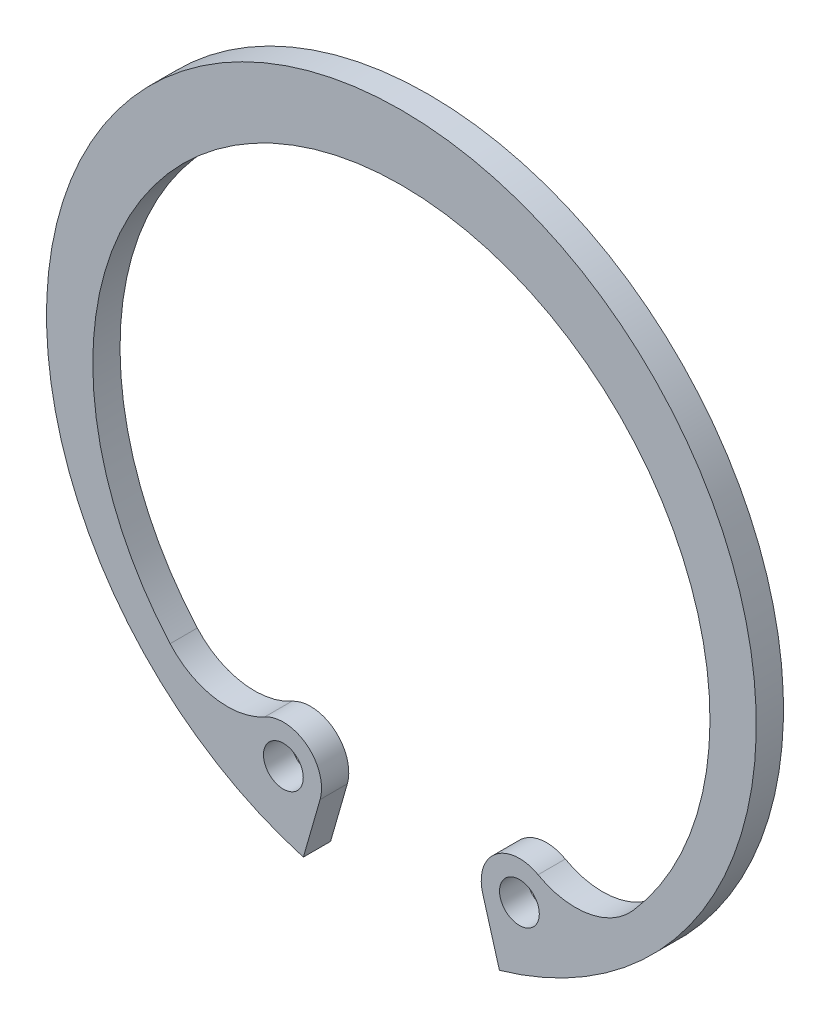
ISO-10303-21;
HEADER;
FILE_DESCRIPTION(('STEP AP214'),'2;1');
FILE_NAME('part.step','',(''),(''),'','','');
FILE_SCHEMA(('AUTOMOTIVE_DESIGN { 1 0 10303 214 1 1 1 1 }'));
ENDSEC;
DATA;
#1=APPLICATION_CONTEXT('core data for automotive mechanical design processes');
#2=APPLICATION_PROTOCOL_DEFINITION('international standard','automotive_design',2000,#1);
#3=PRODUCT_CONTEXT('',#1,'mechanical');
#4=PRODUCT('Part','Part','',(#3));
#5=PRODUCT_RELATED_PRODUCT_CATEGORY('part','',(#4));
#6=PRODUCT_DEFINITION_FORMATION('','',#4);
#7=PRODUCT_DEFINITION_CONTEXT('part definition',#1,'design');
#8=PRODUCT_DEFINITION('design','',#6,#7);
#9=PRODUCT_DEFINITION_SHAPE('','',#8);
#10=(LENGTH_UNIT() NAMED_UNIT(*) SI_UNIT(.MILLI.,.METRE.));
#11=(NAMED_UNIT(*) PLANE_ANGLE_UNIT() SI_UNIT($,.RADIAN.));
#12=(NAMED_UNIT(*) SI_UNIT($,.STERADIAN.) SOLID_ANGLE_UNIT());
#13=UNCERTAINTY_MEASURE_WITH_UNIT(LENGTH_MEASURE(1.E-05),#10,'distance_accuracy_value','');
#14=(GEOMETRIC_REPRESENTATION_CONTEXT(3) GLOBAL_UNCERTAINTY_ASSIGNED_CONTEXT((#13)) GLOBAL_UNIT_ASSIGNED_CONTEXT((#10,
#11,#12)) REPRESENTATION_CONTEXT('',''));
#15=CARTESIAN_POINT('',(0.,0.,0.));
#16=DIRECTION('',(0.,0.,1.));
#17=DIRECTION('',(1.,0.,0.));
#18=AXIS2_PLACEMENT_3D('',#15,#16,#17);
#19=CARTESIAN_POINT('',(0.,0.,-1.3));
#20=DIRECTION('',(0.,0.,1.));
#21=DIRECTION('',(1.,0.,0.));
#22=AXIS2_PLACEMENT_3D('',#19,#20,#21);
#23=CYLINDRICAL_SURFACE('',#22,16.95);
#24=CARTESIAN_POINT('',(0.,0.,0.));
#25=DIRECTION('',(0.,0.,1.));
#26=DIRECTION('',(1.,0.,0.));
#27=AXIS2_PLACEMENT_3D('',#24,#25,#26);
#28=CIRCLE('',#27,16.95);
#29=CARTESIAN_POINT('',(4.68211859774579,-16.2904961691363,0.));
#30=VERTEX_POINT('',#29);
#31=CARTESIAN_POINT('',(-4.68211859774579,-16.2904961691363,0.));
#32=VERTEX_POINT('',#31);
#33=EDGE_CURVE('E99',#30,#32,#28,.T.);
#34=ORIENTED_EDGE('',*,*,#33,.F.);
#35=DIRECTION('',(0.,0.,1.));
#36=VECTOR('',#35,1.);
#37=CARTESIAN_POINT('',(4.68211859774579,-16.2904961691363,-1.3));
#38=LINE('',#37,#36);
#39=CARTESIAN_POINT('',(4.68211859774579,-16.2904961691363,-1.3));
#40=VERTEX_POINT('',#39);
#41=EDGE_CURVE('E11',#40,#30,#38,.T.);
#42=ORIENTED_EDGE('',*,*,#41,.F.);
#43=CARTESIAN_POINT('',(0.,0.,-1.3));
#44=DIRECTION('',(0.,0.,1.));
#45=DIRECTION('',(1.,0.,0.));
#46=AXIS2_PLACEMENT_3D('',#43,#44,#45);
#47=CIRCLE('',#46,16.95);
#48=CARTESIAN_POINT('',(-4.68211859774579,-16.2904961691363,-1.3));
#49=VERTEX_POINT('',#48);
#50=EDGE_CURVE('E101',#40,#49,#47,.T.);
#51=ORIENTED_EDGE('',*,*,#50,.T.);
#52=DIRECTION('',(0.,0.,1.));
#53=VECTOR('',#52,1.);
#54=CARTESIAN_POINT('',(-4.68211859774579,-16.2904961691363,-1.3));
#55=LINE('',#54,#53);
#56=EDGE_CURVE('E38',#49,#32,#55,.T.);
#57=ORIENTED_EDGE('',*,*,#56,.T.);
#58=EDGE_LOOP('',(#34,#42,#51,#57));
#59=FACE_BOUND('',#58,.T.);
#60=ADVANCED_FACE('F35',(#59),#23,.T.);
#61=CARTESIAN_POINT('',(4.68211859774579,-16.2904961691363,-1.3));
#62=DIRECTION('',(-0.961091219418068,-0.276231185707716,0.));
#63=DIRECTION('',(0.276231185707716,-0.961091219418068,0.));
#64=AXIS2_PLACEMENT_3D('',#61,#62,#63);
#65=PLANE('',#64);
#66=DIRECTION('',(0.276231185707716,-0.961091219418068,0.));
#67=VECTOR('',#66,1.);
#68=CARTESIAN_POINT('',(4.68211859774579,-16.2904961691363,0.));
#69=LINE('',#68,#67);
#70=CARTESIAN_POINT('',(3.88298915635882,-13.5100849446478,0.));
#71=VERTEX_POINT('',#70);
#72=EDGE_CURVE('E117',#71,#30,#69,.T.);
#73=ORIENTED_EDGE('',*,*,#72,.F.);
#74=DIRECTION('',(0.,0.,1.));
#75=VECTOR('',#74,1.);
#76=CARTESIAN_POINT('',(3.88298915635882,-13.5100849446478,-1.3));
#77=LINE('',#76,#75);
#78=CARTESIAN_POINT('',(3.88298915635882,-13.5100849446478,-1.3));
#79=VERTEX_POINT('',#78);
#80=EDGE_CURVE('E43',#79,#71,#77,.T.);
#81=ORIENTED_EDGE('',*,*,#80,.F.);
#82=DIRECTION('',(0.276231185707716,-0.961091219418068,0.));
#83=VECTOR('',#82,1.);
#84=CARTESIAN_POINT('',(4.68211859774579,-16.2904961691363,-1.3));
#85=LINE('',#84,#83);
#86=EDGE_CURVE('E106',#79,#40,#85,.T.);
#87=ORIENTED_EDGE('',*,*,#86,.T.);
#88=ORIENTED_EDGE('',*,*,#41,.T.);
#89=EDGE_LOOP('',(#73,#81,#87,#88));
#90=FACE_BOUND('',#89,.T.);
#91=ADVANCED_FACE('F183',(#90),#65,.T.);
#92=CARTESIAN_POINT('',(5.6369806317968,-13.0059630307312,-1.3));
#93=DIRECTION('',(0.,0.,1.));
#94=DIRECTION('',(1.,0.,0.));
#95=AXIS2_PLACEMENT_3D('',#92,#93,#94);
#96=CYLINDRICAL_SURFACE('',#95,1.825);
#97=CARTESIAN_POINT('',(5.6369806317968,-13.0059630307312,0.));
#98=DIRECTION('',(0.,0.,1.));
#99=DIRECTION('',(1.,0.,0.));
#100=AXIS2_PLACEMENT_3D('',#97,#98,#99);
#101=CIRCLE('',#100,1.825);
#102=CARTESIAN_POINT('',(6.52840569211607,-11.4134849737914,0.));
#103=VERTEX_POINT('',#102);
#104=EDGE_CURVE('E135',#103,#71,#101,.T.);
#105=ORIENTED_EDGE('',*,*,#104,.F.);
#106=DIRECTION('',(0.,0.,1.));
#107=VECTOR('',#106,1.);
#108=CARTESIAN_POINT('',(6.52840569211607,-11.4134849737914,-1.3));
#109=LINE('',#108,#107);
#110=CARTESIAN_POINT('',(6.52840569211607,-11.4134849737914,-1.3));
#111=VERTEX_POINT('',#110);
#112=EDGE_CURVE('E157',#111,#103,#109,.T.);
#113=ORIENTED_EDGE('',*,*,#112,.F.);
#114=CARTESIAN_POINT('',(5.6369806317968,-13.0059630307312,-1.3));
#115=DIRECTION('',(0.,0.,1.));
#116=DIRECTION('',(1.,0.,0.));
#117=AXIS2_PLACEMENT_3D('',#114,#115,#116);
#118=CIRCLE('',#117,1.825);
#119=EDGE_CURVE('E153',#111,#79,#118,.T.);
#120=ORIENTED_EDGE('',*,*,#119,.T.);
#121=ORIENTED_EDGE('',*,*,#80,.T.);
#122=EDGE_LOOP('',(#105,#113,#120,#121));
#123=FACE_BOUND('',#122,.T.);
#124=ADVANCED_FACE('F182',(#123),#96,.T.);
#125=CARTESIAN_POINT('',(8.31125581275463,-8.22852885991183,-1.3));
#126=DIRECTION('',(0.,0.,1.));
#127=DIRECTION('',(1.,0.,0.));
#128=AXIS2_PLACEMENT_3D('',#125,#126,#127);
#129=CYLINDRICAL_SURFACE('',#128,3.65);
#130=CARTESIAN_POINT('',(8.31125581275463,-8.22852885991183,0.));
#131=DIRECTION('',(0.,0.,-1.));
#132=DIRECTION('',(1.,0.,0.));
#133=AXIS2_PLACEMENT_3D('',#130,#131,#132);
#134=CIRCLE('',#133,3.65);
#135=CARTESIAN_POINT('',(11.0470830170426,-10.6446723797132,0.));
#136=VERTEX_POINT('',#135);
#137=EDGE_CURVE('E132',#136,#103,#134,.T.);
#138=ORIENTED_EDGE('',*,*,#137,.F.);
#139=DIRECTION('',(0.,0.,1.));
#140=VECTOR('',#139,1.);
#141=CARTESIAN_POINT('',(11.0470830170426,-10.6446723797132,-1.3));
#142=LINE('',#141,#140);
#143=CARTESIAN_POINT('',(11.0470830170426,-10.6446723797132,-1.3));
#144=VERTEX_POINT('',#143);
#145=EDGE_CURVE('E159',#144,#136,#142,.T.);
#146=ORIENTED_EDGE('',*,*,#145,.F.);
#147=CARTESIAN_POINT('',(8.31125581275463,-8.22852885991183,-1.3));
#148=DIRECTION('',(0.,0.,-1.));
#149=DIRECTION('',(1.,0.,0.));
#150=AXIS2_PLACEMENT_3D('',#147,#148,#149);
#151=CIRCLE('',#150,3.65);
#152=EDGE_CURVE('E150',#144,#111,#151,.T.);
#153=ORIENTED_EDGE('',*,*,#152,.T.);
#154=ORIENTED_EDGE('',*,*,#112,.T.);
#155=EDGE_LOOP('',(#138,#146,#153,#154));
#156=FACE_BOUND('',#155,.T.);
#157=ADVANCED_FACE('F178',(#156),#129,.F.);
#158=CARTESIAN_POINT('',(0.,-0.888450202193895,-1.3));
#159=DIRECTION('',(0.,0.,1.));
#160=DIRECTION('',(1.,0.,0.));
#161=AXIS2_PLACEMENT_3D('',#158,#159,#160);
#162=CYLINDRICAL_SURFACE('',#161,14.7384502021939);
#163=CARTESIAN_POINT('',(0.,-0.888450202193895,0.));
#164=DIRECTION('',(0.,0.,-1.));
#165=DIRECTION('',(1.,0.,0.));
#166=AXIS2_PLACEMENT_3D('',#163,#164,#165);
#167=CIRCLE('',#166,14.7384502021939);
#168=CARTESIAN_POINT('',(-11.0470830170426,-10.6446723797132,0.));
#169=VERTEX_POINT('',#168);
#170=EDGE_CURVE('E129',#169,#136,#167,.T.);
#171=ORIENTED_EDGE('',*,*,#170,.F.);
#172=DIRECTION('',(0.,0.,1.));
#173=VECTOR('',#172,1.);
#174=CARTESIAN_POINT('',(-11.0470830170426,-10.6446723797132,-1.3));
#175=LINE('',#174,#173);
#176=CARTESIAN_POINT('',(-11.0470830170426,-10.6446723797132,-1.3));
#177=VERTEX_POINT('',#176);
#178=EDGE_CURVE('E161',#177,#169,#175,.T.);
#179=ORIENTED_EDGE('',*,*,#178,.F.);
#180=CARTESIAN_POINT('',(0.,-0.888450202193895,-1.3));
#181=DIRECTION('',(0.,0.,-1.));
#182=DIRECTION('',(1.,0.,0.));
#183=AXIS2_PLACEMENT_3D('',#180,#181,#182);
#184=CIRCLE('',#183,14.7384502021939);
#185=EDGE_CURVE('E147',#177,#144,#184,.T.);
#186=ORIENTED_EDGE('',*,*,#185,.T.);
#187=ORIENTED_EDGE('',*,*,#145,.T.);
#188=EDGE_LOOP('',(#171,#179,#186,#187));
#189=FACE_BOUND('',#188,.T.);
#190=ADVANCED_FACE('F174',(#189),#162,.F.);
#191=CARTESIAN_POINT('',(-8.31125581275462,-8.22852885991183,-1.3));
#192=DIRECTION('',(0.,0.,1.));
#193=DIRECTION('',(1.,0.,0.));
#194=AXIS2_PLACEMENT_3D('',#191,#192,#193);
#195=CYLINDRICAL_SURFACE('',#194,3.65);
#196=CARTESIAN_POINT('',(-8.31125581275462,-8.22852885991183,0.));
#197=DIRECTION('',(0.,0.,-1.));
#198=DIRECTION('',(1.,0.,0.));
#199=AXIS2_PLACEMENT_3D('',#196,#197,#198);
#200=CIRCLE('',#199,3.65);
#201=CARTESIAN_POINT('',(-6.52840569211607,-11.4134849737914,0.));
#202=VERTEX_POINT('',#201);
#203=EDGE_CURVE('E126',#202,#169,#200,.T.);
#204=ORIENTED_EDGE('',*,*,#203,.F.);
#205=DIRECTION('',(0.,0.,1.));
#206=VECTOR('',#205,1.);
#207=CARTESIAN_POINT('',(-6.52840569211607,-11.4134849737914,-1.3));
#208=LINE('',#207,#206);
#209=CARTESIAN_POINT('',(-6.52840569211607,-11.4134849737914,-1.3));
#210=VERTEX_POINT('',#209);
#211=EDGE_CURVE('E163',#210,#202,#208,.T.);
#212=ORIENTED_EDGE('',*,*,#211,.F.);
#213=CARTESIAN_POINT('',(-8.31125581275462,-8.22852885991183,-1.3));
#214=DIRECTION('',(0.,0.,-1.));
#215=DIRECTION('',(1.,0.,0.));
#216=AXIS2_PLACEMENT_3D('',#213,#214,#215);
#217=CIRCLE('',#216,3.65);
#218=EDGE_CURVE('E144',#210,#177,#217,.T.);
#219=ORIENTED_EDGE('',*,*,#218,.T.);
#220=ORIENTED_EDGE('',*,*,#178,.T.);
#221=EDGE_LOOP('',(#204,#212,#219,#220));
#222=FACE_BOUND('',#221,.T.);
#223=ADVANCED_FACE('F170',(#222),#195,.F.);
#224=CARTESIAN_POINT('',(-5.6369806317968,-13.0059630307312,-1.3));
#225=DIRECTION('',(0.,0.,1.));
#226=DIRECTION('',(1.,0.,0.));
#227=AXIS2_PLACEMENT_3D('',#224,#225,#226);
#228=CYLINDRICAL_SURFACE('',#227,1.825);
#229=CARTESIAN_POINT('',(-5.6369806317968,-13.0059630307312,0.));
#230=DIRECTION('',(0.,0.,1.));
#231=DIRECTION('',(1.,0.,0.));
#232=AXIS2_PLACEMENT_3D('',#229,#230,#231);
#233=CIRCLE('',#232,1.825);
#234=CARTESIAN_POINT('',(-3.88298915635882,-13.5100849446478,0.));
#235=VERTEX_POINT('',#234);
#236=EDGE_CURVE('E113',#235,#202,#233,.T.);
#237=ORIENTED_EDGE('',*,*,#236,.F.);
#238=DIRECTION('',(0.,0.,1.));
#239=VECTOR('',#238,1.);
#240=CARTESIAN_POINT('',(-3.88298915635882,-13.5100849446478,-1.3));
#241=LINE('',#240,#239);
#242=CARTESIAN_POINT('',(-3.88298915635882,-13.5100849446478,-1.3));
#243=VERTEX_POINT('',#242);
#244=EDGE_CURVE('E105',#243,#235,#241,.T.);
#245=ORIENTED_EDGE('',*,*,#244,.F.);
#246=CARTESIAN_POINT('',(-5.6369806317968,-13.0059630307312,-1.3));
#247=DIRECTION('',(0.,0.,1.));
#248=DIRECTION('',(1.,0.,0.));
#249=AXIS2_PLACEMENT_3D('',#246,#247,#248);
#250=CIRCLE('',#249,1.825);
#251=EDGE_CURVE('E141',#243,#210,#250,.T.);
#252=ORIENTED_EDGE('',*,*,#251,.T.);
#253=ORIENTED_EDGE('',*,*,#211,.T.);
#254=EDGE_LOOP('',(#237,#245,#252,#253));
#255=FACE_BOUND('',#254,.T.);
#256=ADVANCED_FACE('F166',(#255),#228,.T.);
#257=CARTESIAN_POINT('',(-4.68211859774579,-16.2904961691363,-1.3));
#258=DIRECTION('',(0.961091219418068,-0.276231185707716,0.));
#259=DIRECTION('',(0.276231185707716,0.961091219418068,0.));
#260=AXIS2_PLACEMENT_3D('',#257,#258,#259);
#261=PLANE('',#260);
#262=DIRECTION('',(0.276231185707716,0.961091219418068,0.));
#263=VECTOR('',#262,1.);
#264=CARTESIAN_POINT('',(-4.68211859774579,-16.2904961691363,0.));
#265=LINE('',#264,#263);
#266=EDGE_CURVE('E108',#32,#235,#265,.T.);
#267=ORIENTED_EDGE('',*,*,#266,.F.);
#268=ORIENTED_EDGE('',*,*,#56,.F.);
#269=DIRECTION('',(0.276231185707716,0.961091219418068,0.));
#270=VECTOR('',#269,1.);
#271=CARTESIAN_POINT('',(-4.68211859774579,-16.2904961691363,-1.3));
#272=LINE('',#271,#270);
#273=EDGE_CURVE('E139',#49,#243,#272,.T.);
#274=ORIENTED_EDGE('',*,*,#273,.T.);
#275=ORIENTED_EDGE('',*,*,#244,.T.);
#276=EDGE_LOOP('',(#267,#268,#274,#275));
#277=FACE_BOUND('',#276,.T.);
#278=ADVANCED_FACE('F109',(#277),#261,.T.);
#279=CARTESIAN_POINT('',(0.,0.,-1.3));
#280=DIRECTION('',(0.,0.,1.));
#281=DIRECTION('',(1.,0.,0.));
#282=AXIS2_PLACEMENT_3D('',#279,#280,#281);
#283=PLANE('',#282);
#284=CARTESIAN_POINT('',(-5.6369806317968,-13.0059630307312,-1.3));
#285=DIRECTION('',(0.,0.,1.));
#286=DIRECTION('',(1.,0.,0.));
#287=AXIS2_PLACEMENT_3D('',#284,#285,#286);
#288=CIRCLE('',#287,0.95);
#289=CARTESIAN_POINT('',(-4.6869806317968,-13.0059630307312,-1.3));
#290=VERTEX_POINT('',#289);
#291=EDGE_CURVE('E259',#290,#290,#288,.T.);
#292=ORIENTED_EDGE('',*,*,#291,.T.);
#293=EDGE_LOOP('',(#292));
#294=FACE_BOUND('',#293,.T.);
#295=CARTESIAN_POINT('',(5.6369806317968,-13.0059630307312,-1.3));
#296=DIRECTION('',(0.,0.,1.));
#297=DIRECTION('',(1.,0.,0.));
#298=AXIS2_PLACEMENT_3D('',#295,#296,#297);
#299=CIRCLE('',#298,0.95);
#300=CARTESIAN_POINT('',(6.5869806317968,-13.0059630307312,-1.3));
#301=VERTEX_POINT('',#300);
#302=EDGE_CURVE('E118',#301,#301,#299,.T.);
#303=ORIENTED_EDGE('',*,*,#302,.T.);
#304=EDGE_LOOP('',(#303));
#305=FACE_BOUND('',#304,.T.);
#306=ORIENTED_EDGE('',*,*,#50,.F.);
#307=ORIENTED_EDGE('',*,*,#86,.F.);
#308=ORIENTED_EDGE('',*,*,#119,.F.);
#309=ORIENTED_EDGE('',*,*,#152,.F.);
#310=ORIENTED_EDGE('',*,*,#185,.F.);
#311=ORIENTED_EDGE('',*,*,#218,.F.);
#312=ORIENTED_EDGE('',*,*,#251,.F.);
#313=ORIENTED_EDGE('',*,*,#273,.F.);
#314=EDGE_LOOP('',(#306,#307,#308,#309,#310,#311,#312,#313));
#315=FACE_BOUND('',#314,.T.);
#316=ADVANCED_FACE('F186',(#294,#305,#315),#283,.F.);
#317=CARTESIAN_POINT('',(0.,0.,0.));
#318=DIRECTION('',(0.,0.,1.));
#319=DIRECTION('',(1.,0.,0.));
#320=AXIS2_PLACEMENT_3D('',#317,#318,#319);
#321=PLANE('',#320);
#322=CARTESIAN_POINT('',(-5.6369806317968,-13.0059630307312,0.));
#323=DIRECTION('',(0.,0.,1.));
#324=DIRECTION('',(1.,0.,0.));
#325=AXIS2_PLACEMENT_3D('',#322,#323,#324);
#326=CIRCLE('',#325,0.95);
#327=CARTESIAN_POINT('',(-4.6869806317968,-13.0059630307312,0.));
#328=VERTEX_POINT('',#327);
#329=EDGE_CURVE('E262',#328,#328,#326,.T.);
#330=ORIENTED_EDGE('',*,*,#329,.F.);
#331=EDGE_LOOP('',(#330));
#332=FACE_BOUND('',#331,.T.);
#333=CARTESIAN_POINT('',(5.6369806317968,-13.0059630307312,0.));
#334=DIRECTION('',(0.,0.,1.));
#335=DIRECTION('',(1.,0.,0.));
#336=AXIS2_PLACEMENT_3D('',#333,#334,#335);
#337=CIRCLE('',#336,0.95);
#338=CARTESIAN_POINT('',(6.5869806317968,-13.0059630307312,0.));
#339=VERTEX_POINT('',#338);
#340=EDGE_CURVE('E121',#339,#339,#337,.T.);
#341=ORIENTED_EDGE('',*,*,#340,.F.);
#342=EDGE_LOOP('',(#341));
#343=FACE_BOUND('',#342,.T.);
#344=ORIENTED_EDGE('',*,*,#33,.T.);
#345=ORIENTED_EDGE('',*,*,#266,.T.);
#346=ORIENTED_EDGE('',*,*,#236,.T.);
#347=ORIENTED_EDGE('',*,*,#203,.T.);
#348=ORIENTED_EDGE('',*,*,#170,.T.);
#349=ORIENTED_EDGE('',*,*,#137,.T.);
#350=ORIENTED_EDGE('',*,*,#104,.T.);
#351=ORIENTED_EDGE('',*,*,#72,.T.);
#352=EDGE_LOOP('',(#344,#345,#346,#347,#348,#349,#350,#351));
#353=FACE_BOUND('',#352,.T.);
#354=ADVANCED_FACE('F115',(#332,#343,#353),#321,.T.);
#355=CARTESIAN_POINT('',(5.6369806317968,-13.0059630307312,-1.3));
#356=DIRECTION('',(0.,0.,1.));
#357=DIRECTION('',(1.,0.,0.));
#358=AXIS2_PLACEMENT_3D('',#355,#356,#357);
#359=CYLINDRICAL_SURFACE('',#358,0.95);
#360=ORIENTED_EDGE('',*,*,#302,.F.);
#361=EDGE_LOOP('',(#360));
#362=FACE_BOUND('',#361,.T.);
#363=ORIENTED_EDGE('',*,*,#340,.T.);
#364=EDGE_LOOP('',(#363));
#365=FACE_BOUND('',#364,.T.);
#366=ADVANCED_FACE('F194',(#362,#365),#359,.F.);
#367=CARTESIAN_POINT('',(-5.6369806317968,-13.0059630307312,-1.3));
#368=DIRECTION('',(0.,0.,1.));
#369=DIRECTION('',(1.,0.,0.));
#370=AXIS2_PLACEMENT_3D('',#367,#368,#369);
#371=CYLINDRICAL_SURFACE('',#370,0.95);
#372=ORIENTED_EDGE('',*,*,#291,.F.);
#373=EDGE_LOOP('',(#372));
#374=FACE_BOUND('',#373,.T.);
#375=ORIENTED_EDGE('',*,*,#329,.T.);
#376=EDGE_LOOP('',(#375));
#377=FACE_BOUND('',#376,.T.);
#378=ADVANCED_FACE('F243',(#374,#377),#371,.F.);
#379=CLOSED_SHELL('',(#60,#91,#124,#157,#190,#223,#256,#278,#316,#354,#366,#378));
#380=MANIFOLD_SOLID_BREP('B2',#379);
#381=ADVANCED_BREP_SHAPE_REPRESENTATION('',(#18,#380),#14);
#382=SHAPE_DEFINITION_REPRESENTATION(#9,#381);
ENDSEC;
END-ISO-10303-21;
